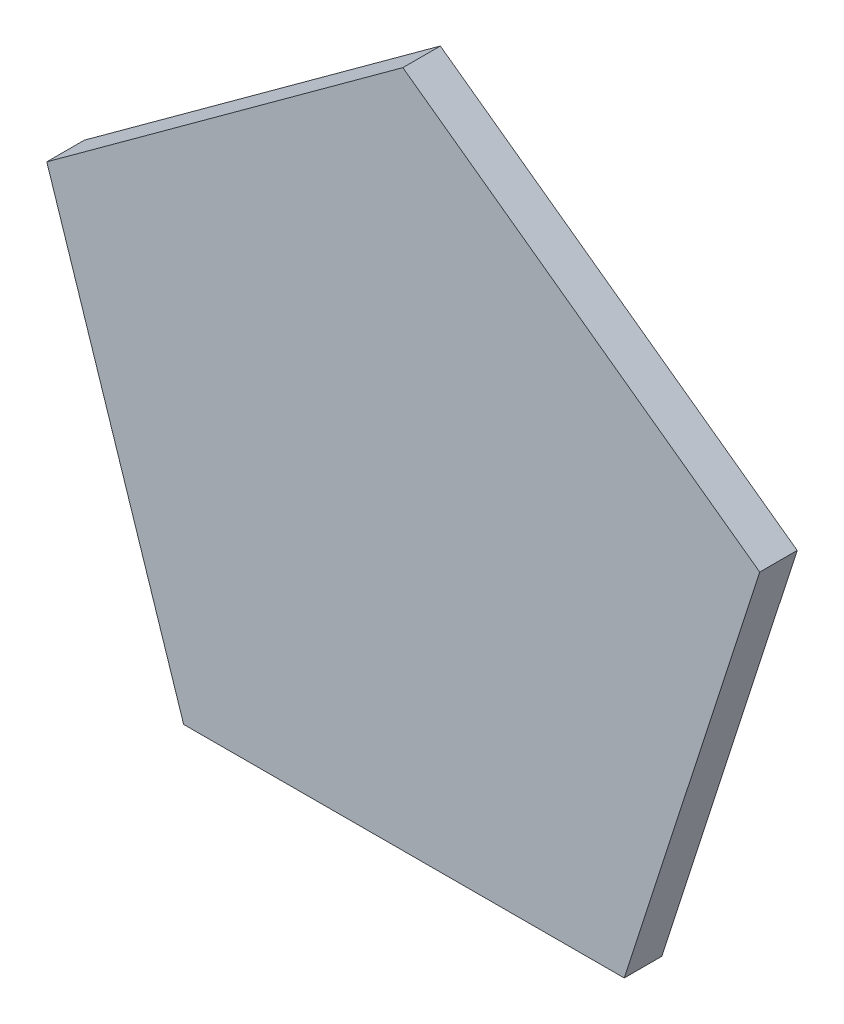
from build123d import *

# Parameters (mm, degrees)
SALIENTE_EXTRUIR1_DEPTH = 1
CORTAR_EXTRUIR1_DEPTH   = 0.5


with BuildPart() as part:
    # Croquis1 → Saliente-Extruir1 (new body)
    with BuildSketch(Plane.XY):
        Polygon((5.891107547, -8.080522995), (9.505486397, 3.105757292), (-0.016393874, 9.999986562), (-9.515618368, 3.074574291), (-5.864581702, -8.099795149), align=None)
    extrude(amount=SALIENTE_EXTRUIR1_DEPTH)

    # Croquis2 → Cortar-Extruir1 (cut)
    with BuildSketch(Plane(origin=(0, 0, 0), x_dir=(-1, 0, 0), z_dir=(0, 0, -1))):
        Polygon((-0.199275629, 9.349993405), (-2.243039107, 3.19041934), (-8.81226451, 3.113838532), align=None)
        Polygon((5.649631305, -7.469742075), (8.953025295, 2.64063156), (3.607114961, -1.482808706), align=None)
        Polygon((8.821462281, 3.085631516), (0.228923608, 9.350024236), (2.243039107, 3.19041934), align=None)
        Polygon((-8.9439876, 2.668946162), (-5.673681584, -7.45244986), (-3.607114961, -1.482808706), align=None)
        Polygon((-5.328734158, -7.681444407), (5.304740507, -7.698876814), (0, -3.9), align=None)
    extrude(amount=-CORTAR_EXTRUIR1_DEPTH, mode=Mode.SUBTRACT)


solid = part.part
